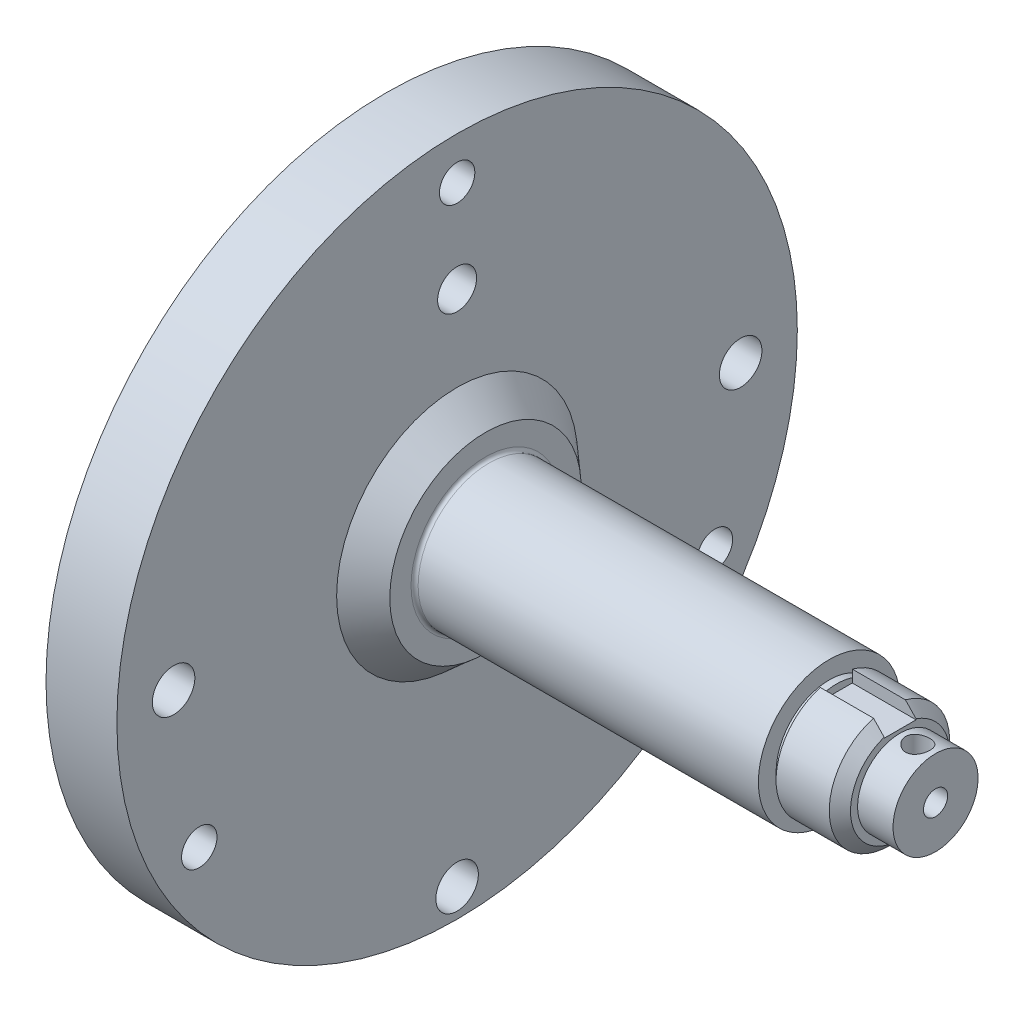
from build123d import *

# Parameters (mm, degrees)
ESQUISSE6_R             = 3
ENL_V_MAT_EXTRU_1_DEPTH = 104.025482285
ESQUISSE7_R             = 3
ENL_V_MAT_EXTRU_2_DEPTH = 104.025482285
TROU_TARAUD_M63_D       = 5
TROU_TARAUD_M63_DEPTH   = 15
TROU_TARAUD_M63_TIP     = 1.502151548
D_GAGEMENT_M37_REACH    = 106.139
D_GAGEMENT_M37_BORE_R   = 1.7
ESQUISSE45_W            = 9
ESQUISSE45_H            = 4.5
ENL_V_MAT_EXTRU_3_DEPTH = 2
D_GAGEMENT_M51_D        = 5.5
D_GAGEMENT_M51_DEPTH    = 12
D_GAGEMENT_M51_TIP      = 1.652366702


with BuildPart() as part:
    # Esquisse1 → R_volution2 (revolve)
    with BuildSketch(Plane.XY, mode=Mode.PRIVATE) as r_volution2_sk:
        with BuildLine():
            Line((0, 0), (76, 0))
            Line((76, 0), (76, -6))
            Line((76, -6), (71, -6))
            Line((71, -6), (71, -7))
            Line((71, -7), (69.5, -8.5))
            Line((69.5, -8.5), (62, -8.5))
            Line((62, -8.5), (62, -7.5))
            Line((62, -7.5), (61, -7.5))
            Line((61, -7.5), (61, -10))
            Line((61, -10), (13, -10))
            ThreePointArc((13, -10), (12.646446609, -10.146446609), (12.5, -10.5))
            Line((12.5, -10.5), (12.5, -13.5))
            Line((12.5, -13.5), (8.5, -17))
            Line((8.5, -17), (8.5, -48))
            Line((8.5, -48), (-1.5, -48))
            Line((-1.5, -48), (-1.5, -35))
            Line((-1.5, -35), (0, -35))
            Line((0, -35), (0, 0))
        make_face()
    revolve(r_volution2_sk.sketch.rotate(Axis((-50.843487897, 0, 0), (1, 0, 0)), 270), axis=Axis((-50.843487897, 0, 0), (1, 0, 0)))

    # Esquisse5 → D_gagement M32 (revolve, cut)
    with BuildSketch(Plane(origin=(76, 0, 0), x_dir=(0, 0, -1), z_dir=(0, 1, 0))):
        Polygon((0, 0), (0, 14.981495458), (1.7, 14), (1.7, 0), align=None)
    revolve(axis=Axis((82.35, 0, 0), (-1, 0, 0)), mode=Mode.SUBTRACT)

    # Esquisse6 → Enl_v. mat.-Extru.1 (cut, through all)
    with BuildSketch(Plane.ZY.offset(1.5)):
        with Locations((-40, 0)):
            Circle(ESQUISSE6_R)
        with Locations((40, 0)):
            Circle(ESQUISSE6_R)
    extrude(amount=-ENL_V_MAT_EXTRU_1_DEPTH, mode=Mode.SUBTRACT)

    # Esquisse7 → Enl_v. mat.-Extru.2 (cut, through all)
    with BuildSketch(Plane.ZY.offset(1.5)):
        with Locations((0, -44)):
            Circle(ESQUISSE7_R)
    extrude(amount=-ENL_V_MAT_EXTRU_2_DEPTH, mode=Mode.SUBTRACT)

    # Trou taraud_ M63
    with Locations(Plane(origin=(-1.5, 42, 0), x_dir=(0, 0, -1), z_dir=(-1, 0, 0))):
        with Locations((0, 0), (36.373066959, 63), (-36.373066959, 63)):
            Hole(TROU_TARAUD_M63_D / 2, depth=TROU_TARAUD_M63_DEPTH)
            with Locations((0, 0, -(TROU_TARAUD_M63_DEPTH + TROU_TARAUD_M63_TIP / 2))):  # 118° drill point
                Cone(0, TROU_TARAUD_M63_D / 2, TROU_TARAUD_M63_TIP, mode=Mode.SUBTRACT)

    # D_gagement M37 bore (on position points) → D_gagement M37 (cut, up to next)
    with BuildSketch(Plane(origin=(73.5, 6, 0), x_dir=(0, 0, 1), z_dir=(0, 1, 0)), mode=Mode.PRIVATE) as d_gagement_m37_sk1:
        Circle(D_GAGEMENT_M37_BORE_R)
    d_gagement_m37_tool1 = extrude(d_gagement_m37_sk1.sketch, amount=-D_GAGEMENT_M37_REACH, mode=Mode.PRIVATE) & part.part
    add(d_gagement_m37_tool1.solids().sort_by_distance((73.5, 6, 0))[0], mode=Mode.SUBTRACT)

    # Esquisse45 → Enl_v. mat.-Extru.3 (cut)
    with BuildSketch(Plane(origin=(0, 8.5, 0), x_dir=(-1, 0, 0), z_dir=(0, 1, 0))):
        with Locations((-66.5, 0)):
            Rectangle(ESQUISSE45_W, ESQUISSE45_H)
    extrude(amount=-ENL_V_MAT_EXTRU_3_DEPTH, mode=Mode.SUBTRACT)

    # D_gagement M51
    with Locations(Plane(origin=(8.5, 29, 0), x_dir=(0, 0, 1), z_dir=(1, 0, 0))):
        with Locations((0, 0)):
            Hole(D_GAGEMENT_M51_D / 2, depth=D_GAGEMENT_M51_DEPTH)
            with Locations((0, 0, -(D_GAGEMENT_M51_DEPTH + D_GAGEMENT_M51_TIP / 2))):  # 118° drill point
                Cone(0, D_GAGEMENT_M51_D / 2, D_GAGEMENT_M51_TIP, mode=Mode.SUBTRACT)


solid = part.part
